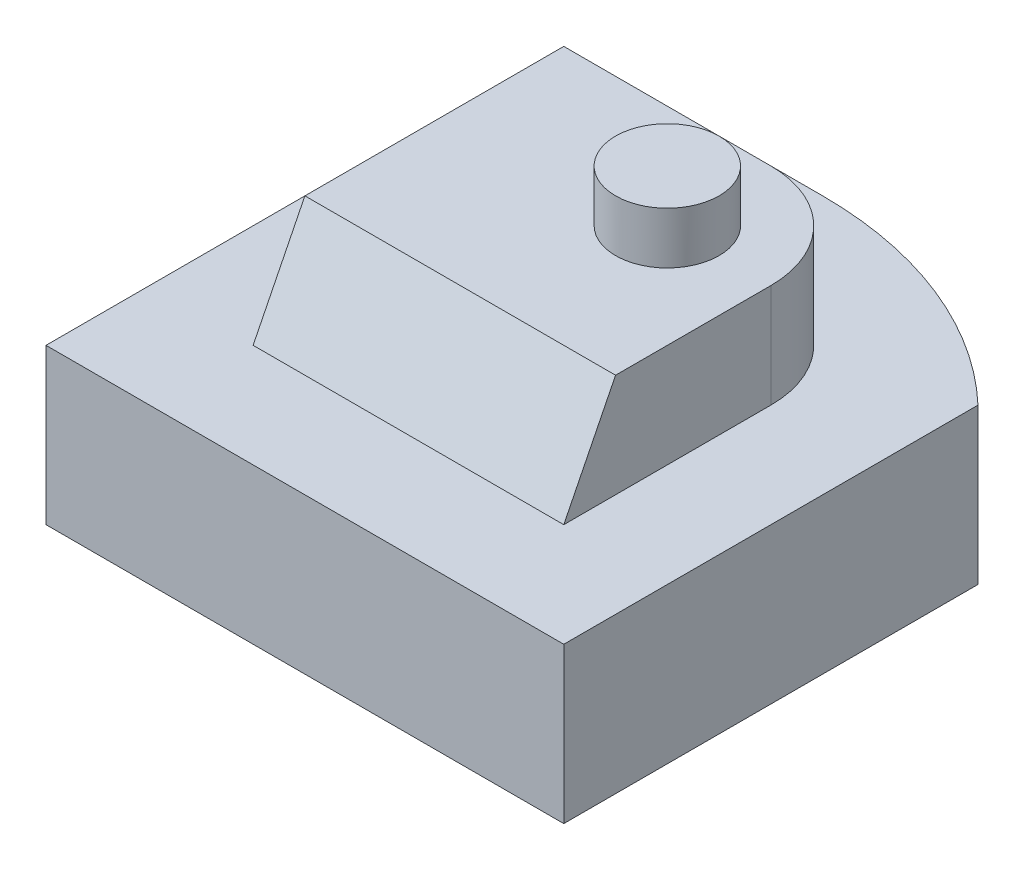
from build123d import *

# Parameters (mm, degrees)
SKETCH_1_W          = 100
SKETCH_1_H          = 100
EXTRUDE_1_DEPTH     = 30
SKETCH_2_W          = 60
SKETCH_2_H          = 60
EXTRUDE_2_DEPTH     = 20
CUT_EXTRUDE_1_DEPTH = 107.77078252
FILLET_1_R          = 20
SKETCH_4_R          = 10
EXTRUDE_3_DEPTH     = 10
CUT_EXTRUDE_2_DEPTH = 77.811457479


with BuildPart() as part:
    # Sketch 1 → Extrude 1 (new body)
    with BuildSketch(Plane(origin=(0, 0, 0), x_dir=(1, 0, 0), z_dir=(0, 1, 0))):
        Rectangle(SKETCH_1_W, SKETCH_1_H)
    extrude(amount=EXTRUDE_1_DEPTH)

    # Sketch 2 → Extrude 2 (add)
    with BuildSketch(Plane(origin=(0, 30, 0), x_dir=(1, 0, 0), z_dir=(0, 1, 0))):
        Rectangle(SKETCH_2_W, SKETCH_2_H)
    extrude(amount=EXTRUDE_2_DEPTH)

    # Sketch 3 → Cut-Extrude 1 (cut, through all)
    with BuildSketch(Plane(origin=(30, 0, 0), x_dir=(0, 0, -1), z_dir=(1, 0, 0))):
        Polygon((-20, 50), (-30, 30), (-30, 50), align=None)
    extrude(amount=-CUT_EXTRUDE_1_DEPTH, mode=Mode.SUBTRACT)

    # Fillet 1
    fillet_1_edges = [part.edges().sort_by_distance(p)[0] for p in [
        (30, 40, -30),
    ]]
    fillet(fillet_1_edges, radius=FILLET_1_R)

    # Sketch 4 → Extrude 3 (add)
    with BuildSketch(Plane(origin=(0, 50, 0), x_dir=(1, 0, 0), z_dir=(0, 1, 0))):
        with Locations(Location((10, 10, 0), (0, 0, 90))):
            Circle(SKETCH_4_R)
    extrude(amount=EXTRUDE_3_DEPTH)

    # Sketch 5 → Cut-Extrude 2 (cut, through all)
    with BuildSketch(Plane(origin=(0, 30, 0), x_dir=(1, 0, 0), z_dir=(0, 1, 0))):
        with BuildLine():
            Line((50, 30), (50, 50))
            Line((50, 50), (0, 50))
            ThreePointArc((0, 50), (26.925824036, 44.814560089), (50, 30))
        make_face()
    extrude(amount=-CUT_EXTRUDE_2_DEPTH, mode=Mode.SUBTRACT)


solid = part.part
